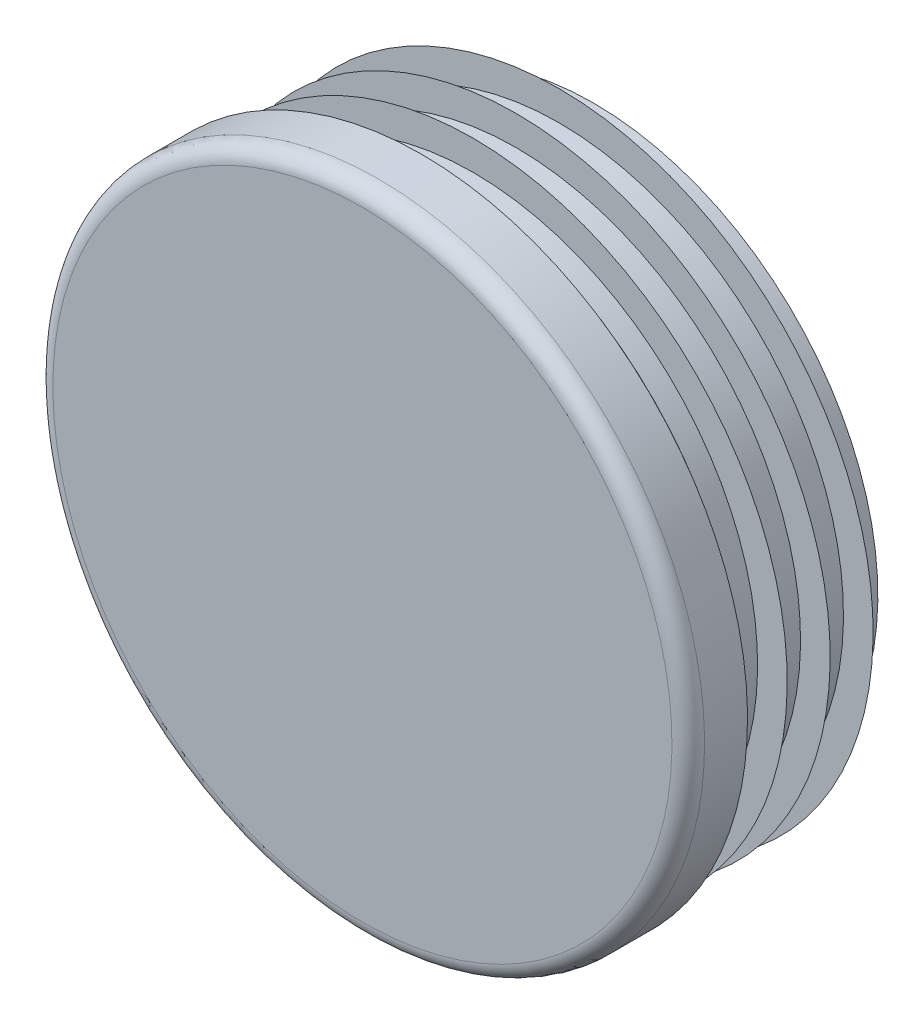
ISO-10303-21;
HEADER;
FILE_DESCRIPTION(('STEP AP214'),'2;1');
FILE_NAME('part.step','',(''),(''),'','','');
FILE_SCHEMA(('AUTOMOTIVE_DESIGN { 1 0 10303 214 1 1 1 1 }'));
ENDSEC;
DATA;
#1=APPLICATION_CONTEXT('core data for automotive mechanical design processes');
#2=APPLICATION_PROTOCOL_DEFINITION('international standard','automotive_design',2000,#1);
#3=PRODUCT_CONTEXT('',#1,'mechanical');
#4=PRODUCT('Part','Part','',(#3));
#5=PRODUCT_RELATED_PRODUCT_CATEGORY('part','',(#4));
#6=PRODUCT_DEFINITION_FORMATION('','',#4);
#7=PRODUCT_DEFINITION_CONTEXT('part definition',#1,'design');
#8=PRODUCT_DEFINITION('design','',#6,#7);
#9=PRODUCT_DEFINITION_SHAPE('','',#8);
#10=(LENGTH_UNIT() NAMED_UNIT(*) SI_UNIT(.MILLI.,.METRE.));
#11=(NAMED_UNIT(*) PLANE_ANGLE_UNIT() SI_UNIT($,.RADIAN.));
#12=(NAMED_UNIT(*) SI_UNIT($,.STERADIAN.) SOLID_ANGLE_UNIT());
#13=UNCERTAINTY_MEASURE_WITH_UNIT(LENGTH_MEASURE(1.E-05),#10,'distance_accuracy_value','');
#14=(GEOMETRIC_REPRESENTATION_CONTEXT(3) GLOBAL_UNCERTAINTY_ASSIGNED_CONTEXT((#13)) GLOBAL_UNIT_ASSIGNED_CONTEXT((#10,
#11,#12)) REPRESENTATION_CONTEXT('',''));
#15=CARTESIAN_POINT('',(0.,0.,0.));
#16=DIRECTION('',(0.,0.,1.));
#17=DIRECTION('',(1.,0.,0.));
#18=AXIS2_PLACEMENT_3D('',#15,#16,#17);
#19=CARTESIAN_POINT('',(0.,0.,5.));
#20=DIRECTION('',(0.,0.,-1.));
#21=DIRECTION('',(0.,1.,0.));
#22=AXIS2_PLACEMENT_3D('',#19,#20,#21);
#23=PLANE('',#22);
#24=CARTESIAN_POINT('',(0.,0.,5.));
#25=DIRECTION('',(0.,0.,-1.));
#26=DIRECTION('',(0.,1.,0.));
#27=AXIS2_PLACEMENT_3D('',#24,#25,#26);
#28=CIRCLE('',#27,26.125);
#29=CARTESIAN_POINT('',(0.,26.125,5.));
#30=VERTEX_POINT('',#29);
#31=EDGE_CURVE('E8',#30,#30,#28,.T.);
#32=ORIENTED_EDGE('',*,*,#31,.F.);
#33=EDGE_LOOP('',(#32));
#34=FACE_BOUND('',#33,.T.);
#35=ADVANCED_FACE('F12',(#34),#23,.F.);
#36=CARTESIAN_POINT('',(0.,0.,3.625));
#37=DIRECTION('',(0.,0.,-1.));
#38=DIRECTION('',(0.,1.,0.));
#39=AXIS2_PLACEMENT_3D('',#36,#37,#38);
#40=TOROIDAL_SURFACE('',#39,26.125,1.375);
#41=ORIENTED_EDGE('',*,*,#31,.T.);
#42=EDGE_LOOP('',(#41));
#43=FACE_BOUND('',#42,.T.);
#44=CARTESIAN_POINT('',(0.,0.,3.625));
#45=DIRECTION('',(0.,0.,-1.));
#46=DIRECTION('',(0.,1.,0.));
#47=AXIS2_PLACEMENT_3D('',#44,#45,#46);
#48=CIRCLE('',#47,27.5);
#49=CARTESIAN_POINT('',(0.,27.5,3.625));
#50=VERTEX_POINT('',#49);
#51=EDGE_CURVE('E18',#50,#50,#48,.T.);
#52=ORIENTED_EDGE('',*,*,#51,.F.);
#53=EDGE_LOOP('',(#52));
#54=FACE_BOUND('',#53,.T.);
#55=ADVANCED_FACE('F159',(#43,#54),#40,.T.);
#56=CARTESIAN_POINT('',(0.,0.,-14.5));
#57=DIRECTION('',(0.,0.,-1.));
#58=DIRECTION('',(0.,1.,0.));
#59=AXIS2_PLACEMENT_3D('',#56,#57,#58);
#60=CYLINDRICAL_SURFACE('',#59,27.5);
#61=CARTESIAN_POINT('',(0.,0.,0.));
#62=DIRECTION('',(0.,0.,-1.));
#63=DIRECTION('',(0.,1.,0.));
#64=AXIS2_PLACEMENT_3D('',#61,#62,#63);
#65=CIRCLE('',#64,27.5);
#66=CARTESIAN_POINT('',(0.,27.5,0.));
#67=VERTEX_POINT('',#66);
#68=EDGE_CURVE('E22',#67,#67,#65,.T.);
#69=ORIENTED_EDGE('',*,*,#68,.F.);
#70=EDGE_LOOP('',(#69));
#71=FACE_BOUND('',#70,.T.);
#72=ORIENTED_EDGE('',*,*,#51,.T.);
#73=EDGE_LOOP('',(#72));
#74=FACE_BOUND('',#73,.T.);
#75=ADVANCED_FACE('F154',(#71,#74),#60,.T.);
#76=CARTESIAN_POINT('',(27.5,0.,0.));
#77=DIRECTION('',(0.,0.,1.));
#78=DIRECTION('',(0.,-1.,0.));
#79=AXIS2_PLACEMENT_3D('',#76,#77,#78);
#80=PLANE('',#79);
#81=CARTESIAN_POINT('',(0.,0.,0.));
#82=DIRECTION('',(0.,0.,-1.));
#83=DIRECTION('',(0.,1.,0.));
#84=AXIS2_PLACEMENT_3D('',#81,#82,#83);
#85=CIRCLE('',#84,24.);
#86=CARTESIAN_POINT('',(0.,24.,0.));
#87=VERTEX_POINT('',#86);
#88=EDGE_CURVE('E26',#87,#87,#85,.T.);
#89=ORIENTED_EDGE('',*,*,#88,.F.);
#90=EDGE_LOOP('',(#89));
#91=FACE_BOUND('',#90,.T.);
#92=ORIENTED_EDGE('',*,*,#68,.T.);
#93=EDGE_LOOP('',(#92));
#94=FACE_BOUND('',#93,.T.);
#95=ADVANCED_FACE('F148',(#91,#94),#80,.F.);
#96=CARTESIAN_POINT('',(0.,0.,-14.5));
#97=DIRECTION('',(0.,0.,-1.));
#98=DIRECTION('',(0.,1.,0.));
#99=AXIS2_PLACEMENT_3D('',#96,#97,#98);
#100=CYLINDRICAL_SURFACE('',#99,24.);
#101=CARTESIAN_POINT('',(0.,0.,-0.725));
#102=DIRECTION('',(0.,0.,-1.));
#103=DIRECTION('',(0.,1.,0.));
#104=AXIS2_PLACEMENT_3D('',#101,#102,#103);
#105=CIRCLE('',#104,24.);
#106=CARTESIAN_POINT('',(0.,24.,-0.725));
#107=VERTEX_POINT('',#106);
#108=EDGE_CURVE('E31',#107,#107,#105,.T.);
#109=ORIENTED_EDGE('',*,*,#108,.F.);
#110=EDGE_LOOP('',(#109));
#111=FACE_BOUND('',#110,.T.);
#112=ORIENTED_EDGE('',*,*,#88,.T.);
#113=EDGE_LOOP('',(#112));
#114=FACE_BOUND('',#113,.T.);
#115=ADVANCED_FACE('F142',(#111,#114),#100,.T.);
#116=CARTESIAN_POINT('',(24.,0.,-0.725));
#117=DIRECTION('',(0.,0.,-1.));
#118=DIRECTION('',(0.,1.,0.));
#119=AXIS2_PLACEMENT_3D('',#116,#117,#118);
#120=PLANE('',#119);
#121=CARTESIAN_POINT('',(0.,0.,-0.725));
#122=DIRECTION('',(0.,0.,-1.));
#123=DIRECTION('',(0.,1.,0.));
#124=AXIS2_PLACEMENT_3D('',#121,#122,#123);
#125=CIRCLE('',#124,26.5);
#126=CARTESIAN_POINT('',(0.,26.5,-0.725));
#127=VERTEX_POINT('',#126);
#128=EDGE_CURVE('E34',#127,#127,#125,.T.);
#129=ORIENTED_EDGE('',*,*,#128,.F.);
#130=EDGE_LOOP('',(#129));
#131=FACE_BOUND('',#130,.T.);
#132=ORIENTED_EDGE('',*,*,#108,.T.);
#133=EDGE_LOOP('',(#132));
#134=FACE_BOUND('',#133,.T.);
#135=ADVANCED_FACE('F136',(#131,#134),#120,.F.);
#136=CARTESIAN_POINT('',(0.,0.,-0.725));
#137=DIRECTION('',(0.,0.,1.));
#138=DIRECTION('',(0.,-1.,0.));
#139=AXIS2_PLACEMENT_3D('',#136,#137,#138);
#140=CONICAL_SURFACE('',#139,26.5,0.959931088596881);
#141=CARTESIAN_POINT('',(0.,0.,-2.47551884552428));
#142=DIRECTION('',(0.,0.,-1.));
#143=DIRECTION('',(0.,1.,0.));
#144=AXIS2_PLACEMENT_3D('',#141,#142,#143);
#145=CIRCLE('',#144,24.);
#146=CARTESIAN_POINT('',(0.,24.,-2.47551884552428));
#147=VERTEX_POINT('',#146);
#148=EDGE_CURVE('E37',#147,#147,#145,.T.);
#149=ORIENTED_EDGE('',*,*,#148,.F.);
#150=EDGE_LOOP('',(#149));
#151=FACE_BOUND('',#150,.T.);
#152=ORIENTED_EDGE('',*,*,#128,.T.);
#153=EDGE_LOOP('',(#152));
#154=FACE_BOUND('',#153,.T.);
#155=ADVANCED_FACE('F130',(#151,#154),#140,.T.);
#156=CARTESIAN_POINT('',(0.,0.,-14.5));
#157=DIRECTION('',(0.,0.,-1.));
#158=DIRECTION('',(0.,1.,0.));
#159=AXIS2_PLACEMENT_3D('',#156,#157,#158);
#160=CYLINDRICAL_SURFACE('',#159,24.);
#161=CARTESIAN_POINT('',(0.,0.,-4.35));
#162=DIRECTION('',(0.,0.,-1.));
#163=DIRECTION('',(0.,1.,0.));
#164=AXIS2_PLACEMENT_3D('',#161,#162,#163);
#165=CIRCLE('',#164,24.);
#166=CARTESIAN_POINT('',(0.,24.,-4.35));
#167=VERTEX_POINT('',#166);
#168=EDGE_CURVE('E40',#167,#167,#165,.T.);
#169=ORIENTED_EDGE('',*,*,#168,.F.);
#170=EDGE_LOOP('',(#169));
#171=FACE_BOUND('',#170,.T.);
#172=ORIENTED_EDGE('',*,*,#148,.T.);
#173=EDGE_LOOP('',(#172));
#174=FACE_BOUND('',#173,.T.);
#175=ADVANCED_FACE('F124',(#171,#174),#160,.T.);
#176=CARTESIAN_POINT('',(24.,0.,-4.35));
#177=DIRECTION('',(0.,0.,-1.));
#178=DIRECTION('',(0.,1.,0.));
#179=AXIS2_PLACEMENT_3D('',#176,#177,#178);
#180=PLANE('',#179);
#181=CARTESIAN_POINT('',(0.,0.,-4.35));
#182=DIRECTION('',(0.,0.,-1.));
#183=DIRECTION('',(0.,1.,0.));
#184=AXIS2_PLACEMENT_3D('',#181,#182,#183);
#185=CIRCLE('',#184,26.5);
#186=CARTESIAN_POINT('',(0.,26.5,-4.35));
#187=VERTEX_POINT('',#186);
#188=EDGE_CURVE('E43',#187,#187,#185,.T.);
#189=ORIENTED_EDGE('',*,*,#188,.F.);
#190=EDGE_LOOP('',(#189));
#191=FACE_BOUND('',#190,.T.);
#192=ORIENTED_EDGE('',*,*,#168,.T.);
#193=EDGE_LOOP('',(#192));
#194=FACE_BOUND('',#193,.T.);
#195=ADVANCED_FACE('F118',(#191,#194),#180,.F.);
#196=CARTESIAN_POINT('',(0.,0.,-4.35));
#197=DIRECTION('',(0.,0.,1.));
#198=DIRECTION('',(0.,-1.,0.));
#199=AXIS2_PLACEMENT_3D('',#196,#197,#198);
#200=CONICAL_SURFACE('',#199,26.5,0.959931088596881);
#201=CARTESIAN_POINT('',(0.,0.,-6.10051884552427));
#202=DIRECTION('',(0.,0.,-1.));
#203=DIRECTION('',(0.,1.,0.));
#204=AXIS2_PLACEMENT_3D('',#201,#202,#203);
#205=CIRCLE('',#204,24.);
#206=CARTESIAN_POINT('',(0.,24.,-6.10051884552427));
#207=VERTEX_POINT('',#206);
#208=EDGE_CURVE('E46',#207,#207,#205,.T.);
#209=ORIENTED_EDGE('',*,*,#208,.F.);
#210=EDGE_LOOP('',(#209));
#211=FACE_BOUND('',#210,.T.);
#212=ORIENTED_EDGE('',*,*,#188,.T.);
#213=EDGE_LOOP('',(#212));
#214=FACE_BOUND('',#213,.T.);
#215=ADVANCED_FACE('F112',(#211,#214),#200,.T.);
#216=CARTESIAN_POINT('',(0.,0.,-14.5));
#217=DIRECTION('',(0.,0.,-1.));
#218=DIRECTION('',(0.,1.,0.));
#219=AXIS2_PLACEMENT_3D('',#216,#217,#218);
#220=CYLINDRICAL_SURFACE('',#219,24.);
#221=CARTESIAN_POINT('',(0.,0.,-7.975));
#222=DIRECTION('',(0.,0.,-1.));
#223=DIRECTION('',(0.,1.,0.));
#224=AXIS2_PLACEMENT_3D('',#221,#222,#223);
#225=CIRCLE('',#224,24.);
#226=CARTESIAN_POINT('',(0.,24.,-7.975));
#227=VERTEX_POINT('',#226);
#228=EDGE_CURVE('E49',#227,#227,#225,.T.);
#229=ORIENTED_EDGE('',*,*,#228,.F.);
#230=EDGE_LOOP('',(#229));
#231=FACE_BOUND('',#230,.T.);
#232=ORIENTED_EDGE('',*,*,#208,.T.);
#233=EDGE_LOOP('',(#232));
#234=FACE_BOUND('',#233,.T.);
#235=ADVANCED_FACE('F106',(#231,#234),#220,.T.);
#236=CARTESIAN_POINT('',(24.,0.,-7.975));
#237=DIRECTION('',(0.,0.,-1.));
#238=DIRECTION('',(0.,1.,0.));
#239=AXIS2_PLACEMENT_3D('',#236,#237,#238);
#240=PLANE('',#239);
#241=CARTESIAN_POINT('',(0.,0.,-7.975));
#242=DIRECTION('',(0.,0.,-1.));
#243=DIRECTION('',(0.,1.,0.));
#244=AXIS2_PLACEMENT_3D('',#241,#242,#243);
#245=CIRCLE('',#244,26.5);
#246=CARTESIAN_POINT('',(0.,26.5,-7.975));
#247=VERTEX_POINT('',#246);
#248=EDGE_CURVE('E52',#247,#247,#245,.T.);
#249=ORIENTED_EDGE('',*,*,#248,.F.);
#250=EDGE_LOOP('',(#249));
#251=FACE_BOUND('',#250,.T.);
#252=ORIENTED_EDGE('',*,*,#228,.T.);
#253=EDGE_LOOP('',(#252));
#254=FACE_BOUND('',#253,.T.);
#255=ADVANCED_FACE('F100',(#251,#254),#240,.F.);
#256=CARTESIAN_POINT('',(0.,0.,-7.975));
#257=DIRECTION('',(0.,0.,1.));
#258=DIRECTION('',(0.,-1.,0.));
#259=AXIS2_PLACEMENT_3D('',#256,#257,#258);
#260=CONICAL_SURFACE('',#259,26.5,0.959931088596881);
#261=CARTESIAN_POINT('',(0.,0.,-9.72551884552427));
#262=DIRECTION('',(0.,0.,-1.));
#263=DIRECTION('',(0.,1.,0.));
#264=AXIS2_PLACEMENT_3D('',#261,#262,#263);
#265=CIRCLE('',#264,24.);
#266=CARTESIAN_POINT('',(0.,24.,-9.72551884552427));
#267=VERTEX_POINT('',#266);
#268=EDGE_CURVE('E55',#267,#267,#265,.T.);
#269=ORIENTED_EDGE('',*,*,#268,.F.);
#270=EDGE_LOOP('',(#269));
#271=FACE_BOUND('',#270,.T.);
#272=ORIENTED_EDGE('',*,*,#248,.T.);
#273=EDGE_LOOP('',(#272));
#274=FACE_BOUND('',#273,.T.);
#275=ADVANCED_FACE('F94',(#271,#274),#260,.T.);
#276=CARTESIAN_POINT('',(0.,0.,-14.5));
#277=DIRECTION('',(0.,0.,-1.));
#278=DIRECTION('',(0.,1.,0.));
#279=AXIS2_PLACEMENT_3D('',#276,#277,#278);
#280=CYLINDRICAL_SURFACE('',#279,24.);
#281=CARTESIAN_POINT('',(0.,0.,-11.6));
#282=DIRECTION('',(0.,0.,-1.));
#283=DIRECTION('',(0.,1.,0.));
#284=AXIS2_PLACEMENT_3D('',#281,#282,#283);
#285=CIRCLE('',#284,24.);
#286=CARTESIAN_POINT('',(0.,24.,-11.6));
#287=VERTEX_POINT('',#286);
#288=EDGE_CURVE('E58',#287,#287,#285,.T.);
#289=ORIENTED_EDGE('',*,*,#288,.F.);
#290=EDGE_LOOP('',(#289));
#291=FACE_BOUND('',#290,.T.);
#292=ORIENTED_EDGE('',*,*,#268,.T.);
#293=EDGE_LOOP('',(#292));
#294=FACE_BOUND('',#293,.T.);
#295=ADVANCED_FACE('F88',(#291,#294),#280,.T.);
#296=CARTESIAN_POINT('',(24.,0.,-11.6));
#297=DIRECTION('',(0.,0.,-1.));
#298=DIRECTION('',(0.,1.,0.));
#299=AXIS2_PLACEMENT_3D('',#296,#297,#298);
#300=PLANE('',#299);
#301=CARTESIAN_POINT('',(0.,0.,-11.6));
#302=DIRECTION('',(0.,0.,-1.));
#303=DIRECTION('',(0.,1.,0.));
#304=AXIS2_PLACEMENT_3D('',#301,#302,#303);
#305=CIRCLE('',#304,26.5);
#306=CARTESIAN_POINT('',(0.,26.5,-11.6));
#307=VERTEX_POINT('',#306);
#308=EDGE_CURVE('E61',#307,#307,#305,.T.);
#309=ORIENTED_EDGE('',*,*,#308,.F.);
#310=EDGE_LOOP('',(#309));
#311=FACE_BOUND('',#310,.T.);
#312=ORIENTED_EDGE('',*,*,#288,.T.);
#313=EDGE_LOOP('',(#312));
#314=FACE_BOUND('',#313,.T.);
#315=ADVANCED_FACE('F82',(#311,#314),#300,.F.);
#316=CARTESIAN_POINT('',(0.,0.,-11.6));
#317=DIRECTION('',(0.,0.,1.));
#318=DIRECTION('',(0.,-1.,0.));
#319=AXIS2_PLACEMENT_3D('',#316,#317,#318);
#320=CONICAL_SURFACE('',#319,26.5,0.959931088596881);
#321=CARTESIAN_POINT('',(0.,0.,-13.3505188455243));
#322=DIRECTION('',(0.,0.,-1.));
#323=DIRECTION('',(0.,1.,0.));
#324=AXIS2_PLACEMENT_3D('',#321,#322,#323);
#325=CIRCLE('',#324,24.);
#326=CARTESIAN_POINT('',(0.,24.,-13.3505188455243));
#327=VERTEX_POINT('',#326);
#328=EDGE_CURVE('E64',#327,#327,#325,.T.);
#329=ORIENTED_EDGE('',*,*,#328,.F.);
#330=EDGE_LOOP('',(#329));
#331=FACE_BOUND('',#330,.T.);
#332=ORIENTED_EDGE('',*,*,#308,.T.);
#333=EDGE_LOOP('',(#332));
#334=FACE_BOUND('',#333,.T.);
#335=ADVANCED_FACE('F76',(#331,#334),#320,.T.);
#336=CARTESIAN_POINT('',(0.,0.,-14.5));
#337=DIRECTION('',(0.,0.,-1.));
#338=DIRECTION('',(0.,1.,0.));
#339=AXIS2_PLACEMENT_3D('',#336,#337,#338);
#340=CYLINDRICAL_SURFACE('',#339,24.);
#341=CARTESIAN_POINT('',(0.,0.,-14.5));
#342=DIRECTION('',(0.,0.,-1.));
#343=DIRECTION('',(0.,1.,0.));
#344=AXIS2_PLACEMENT_3D('',#341,#342,#343);
#345=CIRCLE('',#344,24.);
#346=CARTESIAN_POINT('',(0.,24.,-14.5));
#347=VERTEX_POINT('',#346);
#348=EDGE_CURVE('E67',#347,#347,#345,.T.);
#349=ORIENTED_EDGE('',*,*,#348,.F.);
#350=EDGE_LOOP('',(#349));
#351=FACE_BOUND('',#350,.T.);
#352=ORIENTED_EDGE('',*,*,#328,.T.);
#353=EDGE_LOOP('',(#352));
#354=FACE_BOUND('',#353,.T.);
#355=ADVANCED_FACE('F73',(#351,#354),#340,.T.);
#356=CARTESIAN_POINT('',(24.,0.,-14.5));
#357=DIRECTION('',(0.,0.,1.));
#358=DIRECTION('',(0.,-1.,0.));
#359=AXIS2_PLACEMENT_3D('',#356,#357,#358);
#360=PLANE('',#359);
#361=ORIENTED_EDGE('',*,*,#348,.T.);
#362=EDGE_LOOP('',(#361));
#363=FACE_BOUND('',#362,.T.);
#364=ADVANCED_FACE('F71',(#363),#360,.F.);
#365=CLOSED_SHELL('',(#35,#55,#75,#95,#115,#135,#155,#175,#195,#215,#235,#255,#275,#295,#315,
#335,#355,#364));
#366=MANIFOLD_SOLID_BREP('B1',#365);
#367=ADVANCED_BREP_SHAPE_REPRESENTATION('',(#18,#366),#14);
#368=SHAPE_DEFINITION_REPRESENTATION(#9,#367);
ENDSEC;
END-ISO-10303-21;
